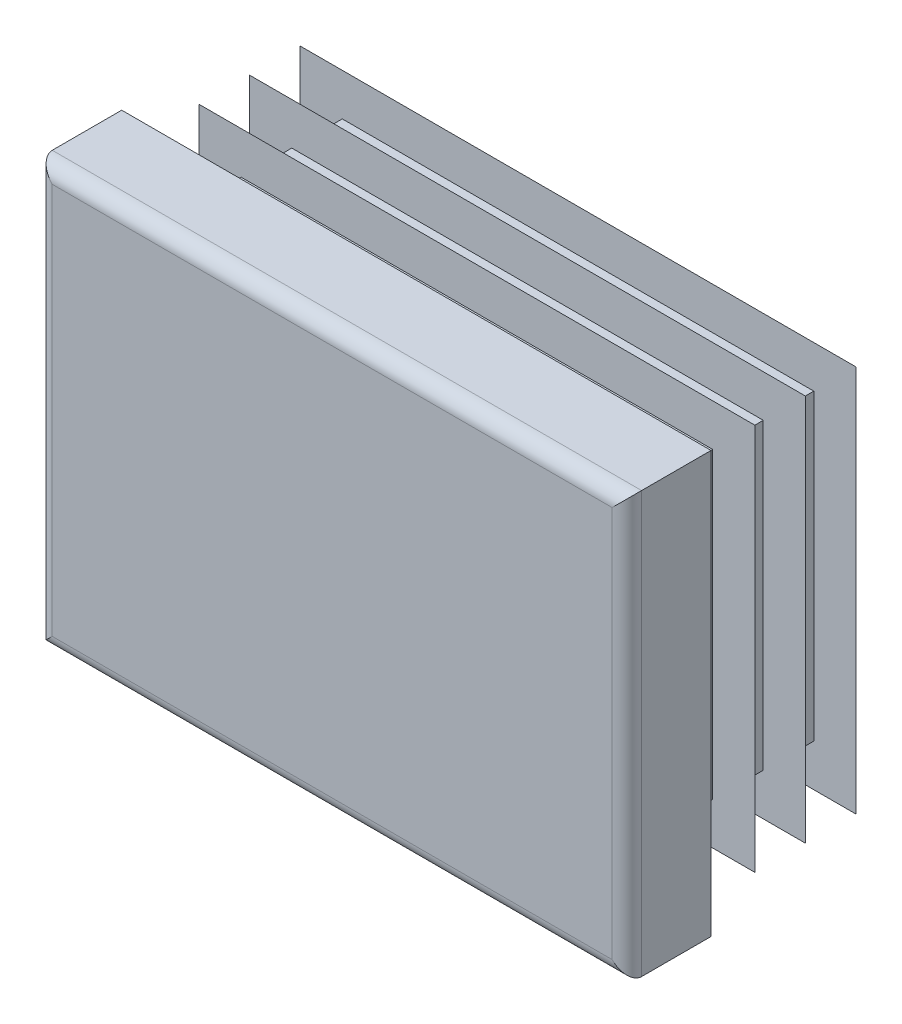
ISO-10303-21;
HEADER;
FILE_DESCRIPTION(('STEP AP214'),'2;1');
FILE_NAME('part.step','',(''),(''),'','','');
FILE_SCHEMA(('AUTOMOTIVE_DESIGN { 1 0 10303 214 1 1 1 1 }'));
ENDSEC;
DATA;
#1=APPLICATION_CONTEXT('core data for automotive mechanical design processes');
#2=APPLICATION_PROTOCOL_DEFINITION('international standard','automotive_design',2000,#1);
#3=PRODUCT_CONTEXT('',#1,'mechanical');
#4=PRODUCT('Part','Part','',(#3));
#5=PRODUCT_RELATED_PRODUCT_CATEGORY('part','',(#4));
#6=PRODUCT_DEFINITION_FORMATION('','',#4);
#7=PRODUCT_DEFINITION_CONTEXT('part definition',#1,'design');
#8=PRODUCT_DEFINITION('design','',#6,#7);
#9=PRODUCT_DEFINITION_SHAPE('','',#8);
#10=(LENGTH_UNIT() NAMED_UNIT(*) SI_UNIT(.MILLI.,.METRE.));
#11=(NAMED_UNIT(*) PLANE_ANGLE_UNIT() SI_UNIT($,.RADIAN.));
#12=(NAMED_UNIT(*) SI_UNIT($,.STERADIAN.) SOLID_ANGLE_UNIT());
#13=UNCERTAINTY_MEASURE_WITH_UNIT(LENGTH_MEASURE(1.E-05),#10,'distance_accuracy_value','');
#14=(GEOMETRIC_REPRESENTATION_CONTEXT(3) GLOBAL_UNCERTAINTY_ASSIGNED_CONTEXT((#13)) GLOBAL_UNIT_ASSIGNED_CONTEXT((#10,
#11,#12)) REPRESENTATION_CONTEXT('',''));
#15=CARTESIAN_POINT('',(0.,0.,0.));
#16=DIRECTION('',(0.,0.,1.));
#17=DIRECTION('',(1.,0.,0.));
#18=AXIS2_PLACEMENT_3D('',#15,#16,#17);
#19=CARTESIAN_POINT('',(16.625,-12.5,5.));
#20=DIRECTION('',(0.,0.,-1.));
#21=DIRECTION('',(0.,1.,0.));
#22=AXIS2_PLACEMENT_3D('',#19,#20,#21);
#23=PLANE('',#22);
#24=DIRECTION('',(0.,1.,0.));
#25=VECTOR('',#24,1.);
#26=CARTESIAN_POINT('',(-16.625,-12.5,5.));
#27=LINE('',#26,#25);
#28=CARTESIAN_POINT('',(-16.625,-11.625,5.));
#29=VERTEX_POINT('',#28);
#30=CARTESIAN_POINT('',(-16.625,11.625,5.));
#31=VERTEX_POINT('',#30);
#32=EDGE_CURVE('E310',#29,#31,#27,.T.);
#33=ORIENTED_EDGE('',*,*,#32,.F.);
#34=DIRECTION('',(-1.,0.,0.));
#35=VECTOR('',#34,1.);
#36=CARTESIAN_POINT('',(17.5,-11.625,5.));
#37=LINE('',#36,#35);
#38=CARTESIAN_POINT('',(16.625,-11.625,5.));
#39=VERTEX_POINT('',#38);
#40=EDGE_CURVE('E482',#39,#29,#37,.T.);
#41=ORIENTED_EDGE('',*,*,#40,.F.);
#42=DIRECTION('',(0.,1.,0.));
#43=VECTOR('',#42,1.);
#44=CARTESIAN_POINT('',(16.625,-12.5,5.));
#45=LINE('',#44,#43);
#46=CARTESIAN_POINT('',(16.625,11.625,5.));
#47=VERTEX_POINT('',#46);
#48=EDGE_CURVE('E305',#39,#47,#45,.T.);
#49=ORIENTED_EDGE('',*,*,#48,.T.);
#50=DIRECTION('',(-1.,0.,0.));
#51=VECTOR('',#50,1.);
#52=CARTESIAN_POINT('',(17.5,11.625,5.));
#53=LINE('',#52,#51);
#54=EDGE_CURVE('E630',#47,#31,#53,.T.);
#55=ORIENTED_EDGE('',*,*,#54,.T.);
#56=EDGE_LOOP('',(#33,#41,#49,#55));
#57=FACE_BOUND('',#56,.T.);
#58=ADVANCED_FACE('F14',(#57),#23,.F.);
#59=CARTESIAN_POINT('',(-16.625,-12.5,4.125));
#60=DIRECTION('',(0.,1.,0.));
#61=DIRECTION('',(-1.,0.,0.));
#62=AXIS2_PLACEMENT_3D('',#59,#60,#61);
#63=CYLINDRICAL_SURFACE('',#62,0.875);
#64=DIRECTION('',(0.,1.,0.));
#65=VECTOR('',#64,1.);
#66=CARTESIAN_POINT('',(-17.5,-12.5,4.125));
#67=LINE('',#66,#65);
#68=CARTESIAN_POINT('',(-17.5,-12.5,4.125));
#69=VERTEX_POINT('',#68);
#70=CARTESIAN_POINT('',(-17.5,12.5,4.125));
#71=VERTEX_POINT('',#70);
#72=EDGE_CURVE('E402',#69,#71,#67,.T.);
#73=ORIENTED_EDGE('',*,*,#72,.F.);
#74=CARTESIAN_POINT('',(-16.625,-11.625,4.125));
#75=DIRECTION('',(-0.707106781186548,0.707106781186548,0.));
#76=DIRECTION('',(0.707106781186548,0.707106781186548,0.));
#77=AXIS2_PLACEMENT_3D('',#74,#75,#76);
#78=ELLIPSE('',#77,1.23743686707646,0.875);
#79=EDGE_CURVE('E59',#69,#29,#78,.T.);
#80=ORIENTED_EDGE('',*,*,#79,.T.);
#81=ORIENTED_EDGE('',*,*,#32,.T.);
#82=CARTESIAN_POINT('',(-16.625,11.625,4.125));
#83=DIRECTION('',(0.707106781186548,0.707106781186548,0.));
#84=DIRECTION('',(-0.707106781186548,0.707106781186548,0.));
#85=AXIS2_PLACEMENT_3D('',#82,#83,#84);
#86=ELLIPSE('',#85,1.23743686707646,0.875);
#87=EDGE_CURVE('E306',#31,#71,#86,.F.);
#88=ORIENTED_EDGE('',*,*,#87,.T.);
#89=EDGE_LOOP('',(#73,#80,#81,#88));
#90=FACE_BOUND('',#89,.T.);
#91=ADVANCED_FACE('F16',(#90),#63,.T.);
#92=CARTESIAN_POINT('',(-17.5,-12.5,4.125));
#93=DIRECTION('',(1.,0.,0.));
#94=DIRECTION('',(0.,1.,0.));
#95=AXIS2_PLACEMENT_3D('',#92,#93,#94);
#96=PLANE('',#95);
#97=DIRECTION('',(0.,0.,-1.));
#98=VECTOR('',#97,1.);
#99=CARTESIAN_POINT('',(-17.5,12.5,4.125));
#100=LINE('',#99,#98);
#101=CARTESIAN_POINT('',(-17.5,12.5,0.));
#102=VERTEX_POINT('',#101);
#103=EDGE_CURVE('E615',#71,#102,#100,.T.);
#104=ORIENTED_EDGE('',*,*,#103,.T.);
#105=DIRECTION('',(0.,1.,0.));
#106=VECTOR('',#105,1.);
#107=CARTESIAN_POINT('',(-17.5,-12.5,0.));
#108=LINE('',#107,#106);
#109=CARTESIAN_POINT('',(-17.5,-12.5,0.));
#110=VERTEX_POINT('',#109);
#111=EDGE_CURVE('E400',#110,#102,#108,.T.);
#112=ORIENTED_EDGE('',*,*,#111,.F.);
#113=DIRECTION('',(0.,0.,-1.));
#114=VECTOR('',#113,1.);
#115=CARTESIAN_POINT('',(-17.5,-12.5,4.125));
#116=LINE('',#115,#114);
#117=EDGE_CURVE('E616',#69,#110,#116,.T.);
#118=ORIENTED_EDGE('',*,*,#117,.F.);
#119=ORIENTED_EDGE('',*,*,#72,.T.);
#120=EDGE_LOOP('',(#104,#112,#118,#119));
#121=FACE_BOUND('',#120,.T.);
#122=ADVANCED_FACE('F697',(#121),#96,.F.);
#123=CARTESIAN_POINT('',(-14.,-12.5,0.));
#124=DIRECTION('',(1.,0.,0.));
#125=DIRECTION('',(0.,1.,0.));
#126=AXIS2_PLACEMENT_3D('',#123,#124,#125);
#127=PLANE('',#126);
#128=DIRECTION('',(0.,1.,0.));
#129=VECTOR('',#128,1.);
#130=CARTESIAN_POINT('',(-14.,-12.5,0.));
#131=LINE('',#130,#129);
#132=CARTESIAN_POINT('',(-14.,-9.,0.));
#133=VERTEX_POINT('',#132);
#134=CARTESIAN_POINT('',(-14.,9.,0.));
#135=VERTEX_POINT('',#134);
#136=EDGE_CURVE('E397',#133,#135,#131,.T.);
#137=ORIENTED_EDGE('',*,*,#136,.T.);
#138=DIRECTION('',(0.,0.,-1.));
#139=VECTOR('',#138,1.);
#140=CARTESIAN_POINT('',(-14.,9.,0.));
#141=LINE('',#140,#139);
#142=CARTESIAN_POINT('',(-14.,9.,-0.6));
#143=VERTEX_POINT('',#142);
#144=EDGE_CURVE('E495',#135,#143,#141,.T.);
#145=ORIENTED_EDGE('',*,*,#144,.T.);
#146=DIRECTION('',(0.,1.,0.));
#147=VECTOR('',#146,1.);
#148=CARTESIAN_POINT('',(-14.,-12.5,-0.6));
#149=LINE('',#148,#147);
#150=CARTESIAN_POINT('',(-14.,-9.,-0.6));
#151=VERTEX_POINT('',#150);
#152=EDGE_CURVE('E394',#151,#143,#149,.T.);
#153=ORIENTED_EDGE('',*,*,#152,.F.);
#154=DIRECTION('',(0.,0.,1.));
#155=VECTOR('',#154,1.);
#156=CARTESIAN_POINT('',(-14.,-9.,0.));
#157=LINE('',#156,#155);
#158=EDGE_CURVE('E489',#151,#133,#157,.T.);
#159=ORIENTED_EDGE('',*,*,#158,.T.);
#160=EDGE_LOOP('',(#137,#145,#153,#159));
#161=FACE_BOUND('',#160,.T.);
#162=ADVANCED_FACE('F787',(#161),#127,.F.);
#163=CARTESIAN_POINT('',(-16.5,-12.5,-0.6));
#164=DIRECTION('',(0.342020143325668,0.,0.939692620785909));
#165=DIRECTION('',(-0.939692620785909,0.,0.342020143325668));
#166=AXIS2_PLACEMENT_3D('',#163,#164,#165);
#167=PLANE('',#166);
#168=DIRECTION('',(0.,1.,0.));
#169=VECTOR('',#168,1.);
#170=CARTESIAN_POINT('',(-16.5,-12.5,-0.6));
#171=LINE('',#170,#169);
#172=CARTESIAN_POINT('',(-16.5,-11.5,-0.6));
#173=VERTEX_POINT('',#172);
#174=CARTESIAN_POINT('',(-16.5,11.5,-0.6));
#175=VERTEX_POINT('',#174);
#176=EDGE_CURVE('E392',#173,#175,#171,.T.);
#177=ORIENTED_EDGE('',*,*,#176,.T.);
#178=DIRECTION('',(0.844349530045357,-0.43889572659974,-0.307318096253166));
#179=VECTOR('',#178,1.);
#180=CARTESIAN_POINT('',(-7.60604638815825,6.87689298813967,-3.83713437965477));
#181=LINE('',#180,#179);
#182=CARTESIAN_POINT('',(-14.,10.2004915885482,-1.5099255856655));
#183=VERTEX_POINT('',#182);
#184=EDGE_CURVE('E519',#175,#183,#181,.T.);
#185=ORIENTED_EDGE('',*,*,#184,.T.);
#186=DIRECTION('',(0.,1.,0.));
#187=VECTOR('',#186,1.);
#188=CARTESIAN_POINT('',(-14.,-12.5,-1.5099255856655));
#189=LINE('',#188,#187);
#190=CARTESIAN_POINT('',(-14.,-10.2004915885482,-1.5099255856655));
#191=VERTEX_POINT('',#190);
#192=EDGE_CURVE('E389',#191,#183,#189,.T.);
#193=ORIENTED_EDGE('',*,*,#192,.F.);
#194=DIRECTION('',(-0.844349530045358,-0.438895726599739,0.307318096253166));
#195=VECTOR('',#194,1.);
#196=CARTESIAN_POINT('',(-16.8705814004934,-11.6926294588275,-0.465119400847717));
#197=LINE('',#196,#195);
#198=EDGE_CURVE('E507',#191,#173,#197,.T.);
#199=ORIENTED_EDGE('',*,*,#198,.T.);
#200=EDGE_LOOP('',(#177,#185,#193,#199));
#201=FACE_BOUND('',#200,.T.);
#202=ADVANCED_FACE('F783',(#201),#167,.F.);
#203=CARTESIAN_POINT('',(-14.,-12.5,-1.5099255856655));
#204=DIRECTION('',(1.,0.,0.));
#205=DIRECTION('',(0.,1.,0.));
#206=AXIS2_PLACEMENT_3D('',#203,#204,#205);
#207=PLANE('',#206);
#208=ORIENTED_EDGE('',*,*,#192,.T.);
#209=DIRECTION('',(0.,-0.819152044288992,-0.573576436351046));
#210=VECTOR('',#209,1.);
#211=CARTESIAN_POINT('',(-14.,-5.0317668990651,-12.1756678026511));
#212=LINE('',#211,#210);
#213=CARTESIAN_POINT('',(-14.,9.,-2.35051884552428));
#214=VERTEX_POINT('',#213);
#215=EDGE_CURVE('E516',#183,#214,#212,.T.);
#216=ORIENTED_EDGE('',*,*,#215,.T.);
#217=DIRECTION('',(0.,0.,-1.));
#218=VECTOR('',#217,1.);
#219=CARTESIAN_POINT('',(-14.,9.,-1.5099255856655));
#220=LINE('',#219,#218);
#221=CARTESIAN_POINT('',(-14.,9.,-3.6));
#222=VERTEX_POINT('',#221);
#223=EDGE_CURVE('E525',#214,#222,#220,.T.);
#224=ORIENTED_EDGE('',*,*,#223,.T.);
#225=DIRECTION('',(0.,1.,0.));
#226=VECTOR('',#225,1.);
#227=CARTESIAN_POINT('',(-14.,-12.5,-3.6));
#228=LINE('',#227,#226);
#229=CARTESIAN_POINT('',(-14.,-9.,-3.6));
#230=VERTEX_POINT('',#229);
#231=EDGE_CURVE('E386',#230,#222,#228,.T.);
#232=ORIENTED_EDGE('',*,*,#231,.F.);
#233=DIRECTION('',(0.,0.,1.));
#234=VECTOR('',#233,1.);
#235=CARTESIAN_POINT('',(-14.,-9.,-1.5099255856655));
#236=LINE('',#235,#234);
#237=CARTESIAN_POINT('',(-14.,-9.,-2.35051884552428));
#238=VERTEX_POINT('',#237);
#239=EDGE_CURVE('E522',#230,#238,#236,.T.);
#240=ORIENTED_EDGE('',*,*,#239,.T.);
#241=DIRECTION('',(0.,-0.819152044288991,0.573576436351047));
#242=VECTOR('',#241,1.);
#243=CARTESIAN_POINT('',(-14.,-11.7434848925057,-0.429510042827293));
#244=LINE('',#243,#242);
#245=EDGE_CURVE('E504',#238,#191,#244,.T.);
#246=ORIENTED_EDGE('',*,*,#245,.T.);
#247=EDGE_LOOP('',(#208,#216,#224,#232,#240,#246));
#248=FACE_BOUND('',#247,.T.);
#249=ADVANCED_FACE('F779',(#248),#207,.F.);
#250=CARTESIAN_POINT('',(-16.5,-12.5,-3.6));
#251=DIRECTION('',(0.34202014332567,0.,0.939692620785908));
#252=DIRECTION('',(-0.939692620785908,0.,0.34202014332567));
#253=AXIS2_PLACEMENT_3D('',#250,#251,#252);
#254=PLANE('',#253);
#255=DIRECTION('',(0.,1.,0.));
#256=VECTOR('',#255,1.);
#257=CARTESIAN_POINT('',(-16.5,-12.5,-3.6));
#258=LINE('',#257,#256);
#259=CARTESIAN_POINT('',(-16.5,-11.5,-3.6));
#260=VERTEX_POINT('',#259);
#261=CARTESIAN_POINT('',(-16.5,11.5,-3.6));
#262=VERTEX_POINT('',#261);
#263=EDGE_CURVE('E384',#260,#262,#258,.T.);
#264=ORIENTED_EDGE('',*,*,#263,.T.);
#265=DIRECTION('',(0.844349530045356,-0.438895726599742,-0.307318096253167));
#266=VECTOR('',#265,1.);
#267=CARTESIAN_POINT('',(-7.60604638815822,6.87689298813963,-6.8371343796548));
#268=LINE('',#267,#266);
#269=CARTESIAN_POINT('',(-14.,10.2004915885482,-4.50992558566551));
#270=VERTEX_POINT('',#269);
#271=EDGE_CURVE('E549',#262,#270,#268,.T.);
#272=ORIENTED_EDGE('',*,*,#271,.T.);
#273=DIRECTION('',(0.,1.,0.));
#274=VECTOR('',#273,1.);
#275=CARTESIAN_POINT('',(-14.,-12.5,-4.50992558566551));
#276=LINE('',#275,#274);
#277=CARTESIAN_POINT('',(-14.,-10.2004915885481,-4.50992558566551));
#278=VERTEX_POINT('',#277);
#279=EDGE_CURVE('E381',#278,#270,#276,.T.);
#280=ORIENTED_EDGE('',*,*,#279,.F.);
#281=DIRECTION('',(-0.844349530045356,-0.438895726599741,0.307318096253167));
#282=VECTOR('',#281,1.);
#283=CARTESIAN_POINT('',(-16.8705814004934,-11.6926294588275,-3.46511940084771));
#284=LINE('',#283,#282);
#285=EDGE_CURVE('E537',#278,#260,#284,.T.);
#286=ORIENTED_EDGE('',*,*,#285,.T.);
#287=EDGE_LOOP('',(#264,#272,#280,#286));
#288=FACE_BOUND('',#287,.T.);
#289=ADVANCED_FACE('F775',(#288),#254,.F.);
#290=CARTESIAN_POINT('',(-14.,-12.5,-4.50992558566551));
#291=DIRECTION('',(1.,0.,0.));
#292=DIRECTION('',(0.,1.,0.));
#293=AXIS2_PLACEMENT_3D('',#290,#291,#292);
#294=PLANE('',#293);
#295=ORIENTED_EDGE('',*,*,#279,.T.);
#296=DIRECTION('',(0.,-0.819152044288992,-0.573576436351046));
#297=VECTOR('',#296,1.);
#298=CARTESIAN_POINT('',(-14.,-5.03176689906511,-15.1756678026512));
#299=LINE('',#298,#297);
#300=CARTESIAN_POINT('',(-14.,9.,-5.35051884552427));
#301=VERTEX_POINT('',#300);
#302=EDGE_CURVE('E546',#270,#301,#299,.T.);
#303=ORIENTED_EDGE('',*,*,#302,.T.);
#304=DIRECTION('',(0.,0.,-1.));
#305=VECTOR('',#304,1.);
#306=CARTESIAN_POINT('',(-14.,9.,-4.50992558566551));
#307=LINE('',#306,#305);
#308=CARTESIAN_POINT('',(-14.,9.,-6.6));
#309=VERTEX_POINT('',#308);
#310=EDGE_CURVE('E555',#301,#309,#307,.T.);
#311=ORIENTED_EDGE('',*,*,#310,.T.);
#312=DIRECTION('',(0.,1.,0.));
#313=VECTOR('',#312,1.);
#314=CARTESIAN_POINT('',(-14.,-12.5,-6.6));
#315=LINE('',#314,#313);
#316=CARTESIAN_POINT('',(-14.,-9.,-6.6));
#317=VERTEX_POINT('',#316);
#318=EDGE_CURVE('E378',#317,#309,#315,.T.);
#319=ORIENTED_EDGE('',*,*,#318,.F.);
#320=DIRECTION('',(0.,0.,1.));
#321=VECTOR('',#320,1.);
#322=CARTESIAN_POINT('',(-14.,-9.,-4.50992558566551));
#323=LINE('',#322,#321);
#324=CARTESIAN_POINT('',(-14.,-9.,-5.35051884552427));
#325=VERTEX_POINT('',#324);
#326=EDGE_CURVE('E552',#317,#325,#323,.T.);
#327=ORIENTED_EDGE('',*,*,#326,.T.);
#328=DIRECTION('',(0.,-0.819152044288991,0.573576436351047));
#329=VECTOR('',#328,1.);
#330=CARTESIAN_POINT('',(-14.,-11.7434848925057,-3.42951004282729));
#331=LINE('',#330,#329);
#332=EDGE_CURVE('E534',#325,#278,#331,.T.);
#333=ORIENTED_EDGE('',*,*,#332,.T.);
#334=EDGE_LOOP('',(#295,#303,#311,#319,#327,#333));
#335=FACE_BOUND('',#334,.T.);
#336=ADVANCED_FACE('F771',(#335),#294,.F.);
#337=CARTESIAN_POINT('',(-16.5,-12.5,-6.6));
#338=DIRECTION('',(0.34202014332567,0.,0.939692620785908));
#339=DIRECTION('',(-0.939692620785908,0.,0.34202014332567));
#340=AXIS2_PLACEMENT_3D('',#337,#338,#339);
#341=PLANE('',#340);
#342=DIRECTION('',(0.,1.,0.));
#343=VECTOR('',#342,1.);
#344=CARTESIAN_POINT('',(-16.5,-12.5,-6.6));
#345=LINE('',#344,#343);
#346=CARTESIAN_POINT('',(-16.5,-11.5,-6.6));
#347=VERTEX_POINT('',#346);
#348=CARTESIAN_POINT('',(-16.5,11.5,-6.6));
#349=VERTEX_POINT('',#348);
#350=EDGE_CURVE('E376',#347,#349,#345,.T.);
#351=ORIENTED_EDGE('',*,*,#350,.T.);
#352=DIRECTION('',(0.844349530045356,-0.438895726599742,-0.307318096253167));
#353=VECTOR('',#352,1.);
#354=CARTESIAN_POINT('',(-7.60604638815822,6.87689298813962,-9.8371343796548));
#355=LINE('',#354,#353);
#356=CARTESIAN_POINT('',(-14.,10.2004915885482,-7.50992558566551));
#357=VERTEX_POINT('',#356);
#358=EDGE_CURVE('E579',#349,#357,#355,.T.);
#359=ORIENTED_EDGE('',*,*,#358,.T.);
#360=DIRECTION('',(0.,1.,0.));
#361=VECTOR('',#360,1.);
#362=CARTESIAN_POINT('',(-14.,-12.5,-7.50992558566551));
#363=LINE('',#362,#361);
#364=CARTESIAN_POINT('',(-14.,-10.2004915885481,-7.50992558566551));
#365=VERTEX_POINT('',#364);
#366=EDGE_CURVE('E373',#365,#357,#363,.T.);
#367=ORIENTED_EDGE('',*,*,#366,.F.);
#368=DIRECTION('',(-0.844349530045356,-0.438895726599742,0.307318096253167));
#369=VECTOR('',#368,1.);
#370=CARTESIAN_POINT('',(-16.8705814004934,-11.6926294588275,-6.46511940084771));
#371=LINE('',#370,#369);
#372=EDGE_CURVE('E567',#365,#347,#371,.T.);
#373=ORIENTED_EDGE('',*,*,#372,.T.);
#374=EDGE_LOOP('',(#351,#359,#367,#373));
#375=FACE_BOUND('',#374,.T.);
#376=ADVANCED_FACE('F767',(#375),#341,.F.);
#377=CARTESIAN_POINT('',(-14.,-12.5,-7.50992558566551));
#378=DIRECTION('',(1.,0.,0.));
#379=DIRECTION('',(0.,1.,0.));
#380=AXIS2_PLACEMENT_3D('',#377,#378,#379);
#381=PLANE('',#380);
#382=ORIENTED_EDGE('',*,*,#366,.T.);
#383=DIRECTION('',(0.,-0.819152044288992,-0.573576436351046));
#384=VECTOR('',#383,1.);
#385=CARTESIAN_POINT('',(-14.,-5.03176689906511,-18.1756678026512));
#386=LINE('',#385,#384);
#387=CARTESIAN_POINT('',(-14.,9.,-8.35051884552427));
#388=VERTEX_POINT('',#387);
#389=EDGE_CURVE('E576',#357,#388,#386,.T.);
#390=ORIENTED_EDGE('',*,*,#389,.T.);
#391=DIRECTION('',(0.,0.,-1.));
#392=VECTOR('',#391,1.);
#393=CARTESIAN_POINT('',(-14.,9.,-7.50992558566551));
#394=LINE('',#393,#392);
#395=CARTESIAN_POINT('',(-14.,9.,-9.6));
#396=VERTEX_POINT('',#395);
#397=EDGE_CURVE('E585',#388,#396,#394,.T.);
#398=ORIENTED_EDGE('',*,*,#397,.T.);
#399=DIRECTION('',(0.,1.,0.));
#400=VECTOR('',#399,1.);
#401=CARTESIAN_POINT('',(-14.,-12.5,-9.6));
#402=LINE('',#401,#400);
#403=CARTESIAN_POINT('',(-14.,-9.,-9.6));
#404=VERTEX_POINT('',#403);
#405=EDGE_CURVE('E370',#404,#396,#402,.T.);
#406=ORIENTED_EDGE('',*,*,#405,.F.);
#407=DIRECTION('',(0.,0.,1.));
#408=VECTOR('',#407,1.);
#409=CARTESIAN_POINT('',(-14.,-9.,-7.50992558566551));
#410=LINE('',#409,#408);
#411=CARTESIAN_POINT('',(-14.,-9.,-8.35051884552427));
#412=VERTEX_POINT('',#411);
#413=EDGE_CURVE('E582',#404,#412,#410,.T.);
#414=ORIENTED_EDGE('',*,*,#413,.T.);
#415=DIRECTION('',(0.,-0.819152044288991,0.573576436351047));
#416=VECTOR('',#415,1.);
#417=CARTESIAN_POINT('',(-14.,-11.7434848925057,-6.42951004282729));
#418=LINE('',#417,#416);
#419=EDGE_CURVE('E564',#412,#365,#418,.T.);
#420=ORIENTED_EDGE('',*,*,#419,.T.);
#421=EDGE_LOOP('',(#382,#390,#398,#406,#414,#420));
#422=FACE_BOUND('',#421,.T.);
#423=ADVANCED_FACE('F764',(#422),#381,.F.);
#424=CARTESIAN_POINT('',(-16.5,-12.5,-9.6));
#425=DIRECTION('',(0.342020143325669,0.,0.939692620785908));
#426=DIRECTION('',(-0.939692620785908,0.,0.342020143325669));
#427=AXIS2_PLACEMENT_3D('',#424,#425,#426);
#428=PLANE('',#427);
#429=DIRECTION('',(0.,1.,0.));
#430=VECTOR('',#429,1.);
#431=CARTESIAN_POINT('',(-16.5,-12.5,-9.6));
#432=LINE('',#431,#430);
#433=CARTESIAN_POINT('',(-16.5,-11.5,-9.6));
#434=VERTEX_POINT('',#433);
#435=CARTESIAN_POINT('',(-16.5,11.5,-9.6));
#436=VERTEX_POINT('',#435);
#437=EDGE_CURVE('E368',#434,#436,#432,.T.);
#438=ORIENTED_EDGE('',*,*,#437,.T.);
#439=DIRECTION('',(0.844349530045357,-0.438895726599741,-0.307318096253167));
#440=VECTOR('',#439,1.);
#441=CARTESIAN_POINT('',(-7.60604638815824,6.87689298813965,-12.8371343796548));
#442=LINE('',#441,#440);
#443=CARTESIAN_POINT('',(-14.,10.2004915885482,-10.5099255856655));
#444=VERTEX_POINT('',#443);
#445=EDGE_CURVE('E607',#436,#444,#442,.T.);
#446=ORIENTED_EDGE('',*,*,#445,.T.);
#447=DIRECTION('',(0.,1.,0.));
#448=VECTOR('',#447,1.);
#449=CARTESIAN_POINT('',(-14.,-12.5,-10.5099255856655));
#450=LINE('',#449,#448);
#451=CARTESIAN_POINT('',(-14.,-10.2004915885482,-10.5099255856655));
#452=VERTEX_POINT('',#451);
#453=EDGE_CURVE('E365',#452,#444,#450,.T.);
#454=ORIENTED_EDGE('',*,*,#453,.F.);
#455=DIRECTION('',(-0.844349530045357,-0.438895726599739,0.307318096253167));
#456=VECTOR('',#455,1.);
#457=CARTESIAN_POINT('',(-16.8705814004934,-11.6926294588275,-9.46511940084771));
#458=LINE('',#457,#456);
#459=EDGE_CURVE('E595',#452,#434,#458,.T.);
#460=ORIENTED_EDGE('',*,*,#459,.T.);
#461=EDGE_LOOP('',(#438,#446,#454,#460));
#462=FACE_BOUND('',#461,.T.);
#463=ADVANCED_FACE('F675',(#462),#428,.F.);
#464=CARTESIAN_POINT('',(-14.,-12.5,-10.5099255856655));
#465=DIRECTION('',(1.,0.,0.));
#466=DIRECTION('',(0.,1.,0.));
#467=AXIS2_PLACEMENT_3D('',#464,#465,#466);
#468=PLANE('',#467);
#469=ORIENTED_EDGE('',*,*,#453,.T.);
#470=DIRECTION('',(0.,-0.819152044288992,-0.573576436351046));
#471=VECTOR('',#470,1.);
#472=CARTESIAN_POINT('',(-14.,-5.0317668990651,-21.1756678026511));
#473=LINE('',#472,#471);
#474=CARTESIAN_POINT('',(-14.,9.,-11.3505188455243));
#475=VERTEX_POINT('',#474);
#476=EDGE_CURVE('E604',#444,#475,#473,.T.);
#477=ORIENTED_EDGE('',*,*,#476,.T.);
#478=DIRECTION('',(0.,0.,-1.));
#479=VECTOR('',#478,1.);
#480=CARTESIAN_POINT('',(-14.,9.,-10.5099255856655));
#481=LINE('',#480,#479);
#482=CARTESIAN_POINT('',(-14.,9.,-12.));
#483=VERTEX_POINT('',#482);
#484=EDGE_CURVE('E613',#475,#483,#481,.T.);
#485=ORIENTED_EDGE('',*,*,#484,.T.);
#486=DIRECTION('',(0.,1.,0.));
#487=VECTOR('',#486,1.);
#488=CARTESIAN_POINT('',(-14.,-12.5,-12.));
#489=LINE('',#488,#487);
#490=CARTESIAN_POINT('',(-14.,-9.,-12.));
#491=VERTEX_POINT('',#490);
#492=EDGE_CURVE('E362',#491,#483,#489,.T.);
#493=ORIENTED_EDGE('',*,*,#492,.F.);
#494=DIRECTION('',(0.,0.,1.));
#495=VECTOR('',#494,1.);
#496=CARTESIAN_POINT('',(-14.,-9.,-10.5099255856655));
#497=LINE('',#496,#495);
#498=CARTESIAN_POINT('',(-14.,-9.,-11.3505188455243));
#499=VERTEX_POINT('',#498);
#500=EDGE_CURVE('E610',#491,#499,#497,.T.);
#501=ORIENTED_EDGE('',*,*,#500,.T.);
#502=DIRECTION('',(0.,-0.81915204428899,0.573576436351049));
#503=VECTOR('',#502,1.);
#504=CARTESIAN_POINT('',(-14.,-11.7434848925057,-9.42951004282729));
#505=LINE('',#504,#503);
#506=EDGE_CURVE('E592',#499,#452,#505,.T.);
#507=ORIENTED_EDGE('',*,*,#506,.T.);
#508=EDGE_LOOP('',(#469,#477,#485,#493,#501,#507));
#509=FACE_BOUND('',#508,.T.);
#510=ADVANCED_FACE('F677',(#509),#468,.F.);
#511=CARTESIAN_POINT('',(-14.,-12.5,-12.));
#512=DIRECTION('',(0.,0.,1.));
#513=DIRECTION('',(0.,-1.,0.));
#514=AXIS2_PLACEMENT_3D('',#511,#512,#513);
#515=PLANE('',#514);
#516=ORIENTED_EDGE('',*,*,#492,.T.);
#517=DIRECTION('',(-1.,0.,0.));
#518=VECTOR('',#517,1.);
#519=CARTESIAN_POINT('',(17.5,9.,-12.));
#520=LINE('',#519,#518);
#521=CARTESIAN_POINT('',(14.,9.,-12.));
#522=VERTEX_POINT('',#521);
#523=EDGE_CURVE('E438',#522,#483,#520,.T.);
#524=ORIENTED_EDGE('',*,*,#523,.F.);
#525=DIRECTION('',(0.,1.,0.));
#526=VECTOR('',#525,1.);
#527=CARTESIAN_POINT('',(14.,-12.5,-12.));
#528=LINE('',#527,#526);
#529=CARTESIAN_POINT('',(14.,-9.,-12.));
#530=VERTEX_POINT('',#529);
#531=EDGE_CURVE('E359',#530,#522,#528,.T.);
#532=ORIENTED_EDGE('',*,*,#531,.F.);
#533=DIRECTION('',(-1.,0.,0.));
#534=VECTOR('',#533,1.);
#535=CARTESIAN_POINT('',(17.5,-9.,-12.));
#536=LINE('',#535,#534);
#537=EDGE_CURVE('E436',#530,#491,#536,.T.);
#538=ORIENTED_EDGE('',*,*,#537,.T.);
#539=EDGE_LOOP('',(#516,#524,#532,#538));
#540=FACE_BOUND('',#539,.T.);
#541=ADVANCED_FACE('F435',(#540),#515,.F.);
#542=CARTESIAN_POINT('',(14.,-12.5,-12.));
#543=DIRECTION('',(-1.,0.,0.));
#544=DIRECTION('',(0.,-1.,0.));
#545=AXIS2_PLACEMENT_3D('',#542,#543,#544);
#546=PLANE('',#545);
#547=DIRECTION('',(0.,0.,1.));
#548=VECTOR('',#547,1.);
#549=CARTESIAN_POINT('',(14.,9.,-12.));
#550=LINE('',#549,#548);
#551=CARTESIAN_POINT('',(14.,9.,-11.3505188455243));
#552=VERTEX_POINT('',#551);
#553=EDGE_CURVE('E9',#522,#552,#550,.T.);
#554=ORIENTED_EDGE('',*,*,#553,.T.);
#555=DIRECTION('',(0.,0.819152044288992,0.573576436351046));
#556=VECTOR('',#555,1.);
#557=CARTESIAN_POINT('',(14.,-5.73187286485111,-21.6658872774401));
#558=LINE('',#557,#556);
#559=CARTESIAN_POINT('',(14.,10.2004915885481,-10.5099255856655));
#560=VERTEX_POINT('',#559);
#561=EDGE_CURVE('E601',#552,#560,#558,.T.);
#562=ORIENTED_EDGE('',*,*,#561,.T.);
#563=DIRECTION('',(0.,1.,0.));
#564=VECTOR('',#563,1.);
#565=CARTESIAN_POINT('',(14.,-12.5,-10.5099255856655));
#566=LINE('',#565,#564);
#567=CARTESIAN_POINT('',(14.,-10.2004915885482,-10.5099255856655));
#568=VERTEX_POINT('',#567);
#569=EDGE_CURVE('E356',#568,#560,#566,.T.);
#570=ORIENTED_EDGE('',*,*,#569,.F.);
#571=DIRECTION('',(0.,0.81915204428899,-0.573576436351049));
#572=VECTOR('',#571,1.);
#573=CARTESIAN_POINT('',(14.,-11.0433789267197,-9.91972951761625));
#574=LINE('',#573,#572);
#575=CARTESIAN_POINT('',(14.,-9.,-11.3505188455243));
#576=VERTEX_POINT('',#575);
#577=EDGE_CURVE('E428',#568,#576,#574,.T.);
#578=ORIENTED_EDGE('',*,*,#577,.T.);
#579=DIRECTION('',(0.,0.,-1.));
#580=VECTOR('',#579,1.);
#581=CARTESIAN_POINT('',(14.,-9.,-12.));
#582=LINE('',#581,#580);
#583=EDGE_CURVE('E23',#576,#530,#582,.T.);
#584=ORIENTED_EDGE('',*,*,#583,.T.);
#585=ORIENTED_EDGE('',*,*,#531,.T.);
#586=EDGE_LOOP('',(#554,#562,#570,#578,#584,#585));
#587=FACE_BOUND('',#586,.T.);
#588=ADVANCED_FACE('F426',(#587),#546,.F.);
#589=CARTESIAN_POINT('',(14.,-12.5,-10.5099255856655));
#590=DIRECTION('',(-0.342020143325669,0.,0.939692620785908));
#591=DIRECTION('',(-0.939692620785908,0.,-0.342020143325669));
#592=AXIS2_PLACEMENT_3D('',#589,#590,#591);
#593=PLANE('',#592);
#594=ORIENTED_EDGE('',*,*,#569,.T.);
#595=DIRECTION('',(0.844349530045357,0.438895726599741,0.307318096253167));
#596=VECTOR('',#595,1.);
#597=CARTESIAN_POINT('',(5.58762003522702,5.82770817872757,-13.5717814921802));
#598=LINE('',#597,#596);
#599=CARTESIAN_POINT('',(16.5,11.5,-9.6));
#600=VERTEX_POINT('',#599);
#601=EDGE_CURVE('E598',#560,#600,#598,.T.);
#602=ORIENTED_EDGE('',*,*,#601,.T.);
#603=DIRECTION('',(0.,1.,0.));
#604=VECTOR('',#603,1.);
#605=CARTESIAN_POINT('',(16.5,-12.5,-9.6));
#606=LINE('',#605,#604);
#607=CARTESIAN_POINT('',(16.5,-11.5,-9.6));
#608=VERTEX_POINT('',#607);
#609=EDGE_CURVE('E353',#608,#600,#606,.T.);
#610=ORIENTED_EDGE('',*,*,#609,.F.);
#611=DIRECTION('',(-0.844349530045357,0.438895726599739,-0.307318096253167));
#612=VECTOR('',#611,1.);
#613=CARTESIAN_POINT('',(14.8521550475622,-10.6434446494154,-10.1997665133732));
#614=LINE('',#613,#612);
#615=EDGE_CURVE('E588',#608,#568,#614,.T.);
#616=ORIENTED_EDGE('',*,*,#615,.T.);
#617=EDGE_LOOP('',(#594,#602,#610,#616));
#618=FACE_BOUND('',#617,.T.);
#619=ADVANCED_FACE('F752',(#618),#593,.F.);
#620=CARTESIAN_POINT('',(16.5,-12.5,-9.6));
#621=DIRECTION('',(0.,0.,-1.));
#622=DIRECTION('',(0.,1.,0.));
#623=AXIS2_PLACEMENT_3D('',#620,#621,#622);
#624=PLANE('',#623);
#625=ORIENTED_EDGE('',*,*,#609,.T.);
#626=DIRECTION('',(-1.,0.,0.));
#627=VECTOR('',#626,1.);
#628=CARTESIAN_POINT('',(17.5,11.5,-9.6));
#629=LINE('',#628,#627);
#630=EDGE_CURVE('E444',#600,#436,#629,.T.);
#631=ORIENTED_EDGE('',*,*,#630,.T.);
#632=ORIENTED_EDGE('',*,*,#437,.F.);
#633=DIRECTION('',(-1.,0.,0.));
#634=VECTOR('',#633,1.);
#635=CARTESIAN_POINT('',(17.5,-11.5,-9.6));
#636=LINE('',#635,#634);
#637=EDGE_CURVE('E451',#608,#434,#636,.T.);
#638=ORIENTED_EDGE('',*,*,#637,.F.);
#639=EDGE_LOOP('',(#625,#631,#632,#638));
#640=FACE_BOUND('',#639,.T.);
#641=ORIENTED_EDGE('',*,*,#405,.T.);
#642=DIRECTION('',(-1.,0.,0.));
#643=VECTOR('',#642,1.);
#644=CARTESIAN_POINT('',(17.5,9.,-9.6));
#645=LINE('',#644,#643);
#646=CARTESIAN_POINT('',(14.,9.,-9.6));
#647=VERTEX_POINT('',#646);
#648=EDGE_CURVE('E663',#647,#396,#645,.T.);
#649=ORIENTED_EDGE('',*,*,#648,.F.);
#650=DIRECTION('',(0.,1.,0.));
#651=VECTOR('',#650,1.);
#652=CARTESIAN_POINT('',(14.,-12.5,-9.6));
#653=LINE('',#652,#651);
#654=CARTESIAN_POINT('',(14.,-9.,-9.6));
#655=VERTEX_POINT('',#654);
#656=EDGE_CURVE('E350',#655,#647,#653,.T.);
#657=ORIENTED_EDGE('',*,*,#656,.F.);
#658=DIRECTION('',(-1.,0.,0.));
#659=VECTOR('',#658,1.);
#660=CARTESIAN_POINT('',(17.5,-9.,-9.6));
#661=LINE('',#660,#659);
#662=EDGE_CURVE('E453',#655,#404,#661,.T.);
#663=ORIENTED_EDGE('',*,*,#662,.T.);
#664=EDGE_LOOP('',(#641,#649,#657,#663));
#665=FACE_BOUND('',#664,.T.);
#666=ADVANCED_FACE('F667',(#640,#665),#624,.F.);
#667=CARTESIAN_POINT('',(14.,-12.5,-9.6));
#668=DIRECTION('',(-1.,0.,0.));
#669=DIRECTION('',(0.,-1.,0.));
#670=AXIS2_PLACEMENT_3D('',#667,#668,#669);
#671=PLANE('',#670);
#672=DIRECTION('',(0.,0.,1.));
#673=VECTOR('',#672,1.);
#674=CARTESIAN_POINT('',(14.,9.,-9.6));
#675=LINE('',#674,#673);
#676=CARTESIAN_POINT('',(14.,9.,-8.35051884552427));
#677=VERTEX_POINT('',#676);
#678=EDGE_CURVE('E420',#647,#677,#675,.T.);
#679=ORIENTED_EDGE('',*,*,#678,.T.);
#680=DIRECTION('',(0.,0.819152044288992,0.573576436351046));
#681=VECTOR('',#680,1.);
#682=CARTESIAN_POINT('',(14.,-6.01378065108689,-18.8632812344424));
#683=LINE('',#682,#681);
#684=CARTESIAN_POINT('',(14.,10.2004915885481,-7.50992558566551));
#685=VERTEX_POINT('',#684);
#686=EDGE_CURVE('E573',#677,#685,#683,.T.);
#687=ORIENTED_EDGE('',*,*,#686,.T.);
#688=DIRECTION('',(0.,1.,0.));
#689=VECTOR('',#688,1.);
#690=CARTESIAN_POINT('',(14.,-12.5,-7.50992558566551));
#691=LINE('',#690,#689);
#692=CARTESIAN_POINT('',(14.,-10.2004915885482,-7.50992558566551));
#693=VERTEX_POINT('',#692);
#694=EDGE_CURVE('E347',#693,#685,#691,.T.);
#695=ORIENTED_EDGE('',*,*,#694,.F.);
#696=DIRECTION('',(0.,0.819152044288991,-0.573576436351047));
#697=VECTOR('',#696,1.);
#698=CARTESIAN_POINT('',(14.,-10.761471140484,-7.11712347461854));
#699=LINE('',#698,#697);
#700=CARTESIAN_POINT('',(14.,-9.,-8.35051884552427));
#701=VERTEX_POINT('',#700);
#702=EDGE_CURVE('E561',#693,#701,#699,.T.);
#703=ORIENTED_EDGE('',*,*,#702,.T.);
#704=DIRECTION('',(0.,0.,-1.));
#705=VECTOR('',#704,1.);
#706=CARTESIAN_POINT('',(14.,-9.,-9.6));
#707=LINE('',#706,#705);
#708=EDGE_CURVE('E417',#701,#655,#707,.T.);
#709=ORIENTED_EDGE('',*,*,#708,.T.);
#710=ORIENTED_EDGE('',*,*,#656,.T.);
#711=EDGE_LOOP('',(#679,#687,#695,#703,#709,#710));
#712=FACE_BOUND('',#711,.T.);
#713=ADVANCED_FACE('F745',(#712),#671,.F.);
#714=CARTESIAN_POINT('',(14.,-12.5,-7.50992558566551));
#715=DIRECTION('',(-0.342020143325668,0.,0.939692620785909));
#716=DIRECTION('',(-0.939692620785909,0.,-0.342020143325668));
#717=AXIS2_PLACEMENT_3D('',#714,#715,#716);
#718=PLANE('',#717);
#719=ORIENTED_EDGE('',*,*,#694,.T.);
#720=DIRECTION('',(0.844349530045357,0.438895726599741,0.307318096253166));
#721=VECTOR('',#720,1.);
#722=CARTESIAN_POINT('',(5.58762003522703,5.82770817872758,-10.5717814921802));
#723=LINE('',#722,#721);
#724=CARTESIAN_POINT('',(16.5,11.5,-6.6));
#725=VERTEX_POINT('',#724);
#726=EDGE_CURVE('E570',#685,#725,#723,.T.);
#727=ORIENTED_EDGE('',*,*,#726,.T.);
#728=DIRECTION('',(0.,1.,0.));
#729=VECTOR('',#728,1.);
#730=CARTESIAN_POINT('',(16.5,-12.5,-6.6));
#731=LINE('',#730,#729);
#732=CARTESIAN_POINT('',(16.5,-11.5,-6.6));
#733=VERTEX_POINT('',#732);
#734=EDGE_CURVE('E344',#733,#725,#731,.T.);
#735=ORIENTED_EDGE('',*,*,#734,.F.);
#736=DIRECTION('',(-0.844349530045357,0.43889572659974,-0.307318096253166));
#737=VECTOR('',#736,1.);
#738=CARTESIAN_POINT('',(14.8521550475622,-10.6434446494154,-7.19976651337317));
#739=LINE('',#738,#737);
#740=EDGE_CURVE('E558',#733,#693,#739,.T.);
#741=ORIENTED_EDGE('',*,*,#740,.T.);
#742=EDGE_LOOP('',(#719,#727,#735,#741));
#743=FACE_BOUND('',#742,.T.);
#744=ADVANCED_FACE('F741',(#743),#718,.F.);
#745=CARTESIAN_POINT('',(16.5,-12.5,-6.6));
#746=DIRECTION('',(0.,0.,-1.));
#747=DIRECTION('',(0.,1.,0.));
#748=AXIS2_PLACEMENT_3D('',#745,#746,#747);
#749=PLANE('',#748);
#750=ORIENTED_EDGE('',*,*,#734,.T.);
#751=DIRECTION('',(-1.,0.,0.));
#752=VECTOR('',#751,1.);
#753=CARTESIAN_POINT('',(17.5,11.5,-6.6));
#754=LINE('',#753,#752);
#755=EDGE_CURVE('E657',#725,#349,#754,.T.);
#756=ORIENTED_EDGE('',*,*,#755,.T.);
#757=ORIENTED_EDGE('',*,*,#350,.F.);
#758=DIRECTION('',(-1.,0.,0.));
#759=VECTOR('',#758,1.);
#760=CARTESIAN_POINT('',(17.5,-11.5,-6.6));
#761=LINE('',#760,#759);
#762=EDGE_CURVE('E459',#733,#347,#761,.T.);
#763=ORIENTED_EDGE('',*,*,#762,.F.);
#764=EDGE_LOOP('',(#750,#756,#757,#763));
#765=FACE_BOUND('',#764,.T.);
#766=ORIENTED_EDGE('',*,*,#318,.T.);
#767=DIRECTION('',(-1.,0.,0.));
#768=VECTOR('',#767,1.);
#769=CARTESIAN_POINT('',(17.5,9.,-6.6));
#770=LINE('',#769,#768);
#771=CARTESIAN_POINT('',(14.,9.,-6.6));
#772=VERTEX_POINT('',#771);
#773=EDGE_CURVE('E655',#772,#309,#770,.T.);
#774=ORIENTED_EDGE('',*,*,#773,.F.);
#775=DIRECTION('',(0.,1.,0.));
#776=VECTOR('',#775,1.);
#777=CARTESIAN_POINT('',(14.,-12.5,-6.6));
#778=LINE('',#777,#776);
#779=CARTESIAN_POINT('',(14.,-9.,-6.6));
#780=VERTEX_POINT('',#779);
#781=EDGE_CURVE('E341',#780,#772,#778,.T.);
#782=ORIENTED_EDGE('',*,*,#781,.F.);
#783=DIRECTION('',(-1.,0.,0.));
#784=VECTOR('',#783,1.);
#785=CARTESIAN_POINT('',(17.5,-9.,-6.6));
#786=LINE('',#785,#784);
#787=EDGE_CURVE('E461',#780,#317,#786,.T.);
#788=ORIENTED_EDGE('',*,*,#787,.T.);
#789=EDGE_LOOP('',(#766,#774,#782,#788));
#790=FACE_BOUND('',#789,.T.);
#791=ADVANCED_FACE('F737',(#765,#790),#749,.F.);
#792=CARTESIAN_POINT('',(14.,-12.5,-6.6));
#793=DIRECTION('',(-1.,0.,0.));
#794=DIRECTION('',(0.,-1.,0.));
#795=AXIS2_PLACEMENT_3D('',#792,#793,#794);
#796=PLANE('',#795);
#797=DIRECTION('',(0.,0.,1.));
#798=VECTOR('',#797,1.);
#799=CARTESIAN_POINT('',(14.,9.,-6.6));
#800=LINE('',#799,#798);
#801=CARTESIAN_POINT('',(14.,9.,-5.35051884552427));
#802=VERTEX_POINT('',#801);
#803=EDGE_CURVE('E414',#772,#802,#800,.T.);
#804=ORIENTED_EDGE('',*,*,#803,.T.);
#805=DIRECTION('',(0.,0.819152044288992,0.573576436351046));
#806=VECTOR('',#805,1.);
#807=CARTESIAN_POINT('',(14.,-6.01378065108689,-15.8632812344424));
#808=LINE('',#807,#806);
#809=CARTESIAN_POINT('',(14.,10.2004915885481,-4.50992558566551));
#810=VERTEX_POINT('',#809);
#811=EDGE_CURVE('E543',#802,#810,#808,.T.);
#812=ORIENTED_EDGE('',*,*,#811,.T.);
#813=DIRECTION('',(0.,1.,0.));
#814=VECTOR('',#813,1.);
#815=CARTESIAN_POINT('',(14.,-12.5,-4.50992558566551));
#816=LINE('',#815,#814);
#817=CARTESIAN_POINT('',(14.,-10.2004915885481,-4.50992558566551));
#818=VERTEX_POINT('',#817);
#819=EDGE_CURVE('E338',#818,#810,#816,.T.);
#820=ORIENTED_EDGE('',*,*,#819,.F.);
#821=DIRECTION('',(0.,0.819152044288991,-0.573576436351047));
#822=VECTOR('',#821,1.);
#823=CARTESIAN_POINT('',(14.,-10.761471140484,-4.11712347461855));
#824=LINE('',#823,#822);
#825=CARTESIAN_POINT('',(14.,-9.,-5.35051884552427));
#826=VERTEX_POINT('',#825);
#827=EDGE_CURVE('E531',#818,#826,#824,.T.);
#828=ORIENTED_EDGE('',*,*,#827,.T.);
#829=DIRECTION('',(0.,0.,-1.));
#830=VECTOR('',#829,1.);
#831=CARTESIAN_POINT('',(14.,-9.,-6.6));
#832=LINE('',#831,#830);
#833=EDGE_CURVE('E411',#826,#780,#832,.T.);
#834=ORIENTED_EDGE('',*,*,#833,.T.);
#835=ORIENTED_EDGE('',*,*,#781,.T.);
#836=EDGE_LOOP('',(#804,#812,#820,#828,#834,#835));
#837=FACE_BOUND('',#836,.T.);
#838=ADVANCED_FACE('F733',(#837),#796,.F.);
#839=CARTESIAN_POINT('',(14.,-12.5,-4.50992558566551));
#840=DIRECTION('',(-0.342020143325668,0.,0.939692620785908));
#841=DIRECTION('',(-0.939692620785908,0.,-0.342020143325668));
#842=AXIS2_PLACEMENT_3D('',#839,#840,#841);
#843=PLANE('',#842);
#844=ORIENTED_EDGE('',*,*,#819,.T.);
#845=DIRECTION('',(0.844349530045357,0.438895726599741,0.307318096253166));
#846=VECTOR('',#845,1.);
#847=CARTESIAN_POINT('',(5.58762003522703,5.82770817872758,-7.57178149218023));
#848=LINE('',#847,#846);
#849=CARTESIAN_POINT('',(16.5,11.5,-3.6));
#850=VERTEX_POINT('',#849);
#851=EDGE_CURVE('E540',#810,#850,#848,.T.);
#852=ORIENTED_EDGE('',*,*,#851,.T.);
#853=DIRECTION('',(0.,1.,0.));
#854=VECTOR('',#853,1.);
#855=CARTESIAN_POINT('',(16.5,-12.5,-3.6));
#856=LINE('',#855,#854);
#857=CARTESIAN_POINT('',(16.5,-11.5,-3.6));
#858=VERTEX_POINT('',#857);
#859=EDGE_CURVE('E335',#858,#850,#856,.T.);
#860=ORIENTED_EDGE('',*,*,#859,.F.);
#861=DIRECTION('',(-0.844349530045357,0.43889572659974,-0.307318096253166));
#862=VECTOR('',#861,1.);
#863=CARTESIAN_POINT('',(14.8521550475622,-10.6434446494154,-4.19976651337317));
#864=LINE('',#863,#862);
#865=EDGE_CURVE('E528',#858,#818,#864,.T.);
#866=ORIENTED_EDGE('',*,*,#865,.T.);
#867=EDGE_LOOP('',(#844,#852,#860,#866));
#868=FACE_BOUND('',#867,.T.);
#869=ADVANCED_FACE('F729',(#868),#843,.F.);
#870=CARTESIAN_POINT('',(16.5,-12.5,-3.6));
#871=DIRECTION('',(0.,0.,-1.));
#872=DIRECTION('',(0.,1.,0.));
#873=AXIS2_PLACEMENT_3D('',#870,#871,#872);
#874=PLANE('',#873);
#875=ORIENTED_EDGE('',*,*,#859,.T.);
#876=DIRECTION('',(-1.,0.,0.));
#877=VECTOR('',#876,1.);
#878=CARTESIAN_POINT('',(17.5,11.5,-3.6));
#879=LINE('',#878,#877);
#880=EDGE_CURVE('E649',#850,#262,#879,.T.);
#881=ORIENTED_EDGE('',*,*,#880,.T.);
#882=ORIENTED_EDGE('',*,*,#263,.F.);
#883=DIRECTION('',(-1.,0.,0.));
#884=VECTOR('',#883,1.);
#885=CARTESIAN_POINT('',(17.5,-11.5,-3.6));
#886=LINE('',#885,#884);
#887=EDGE_CURVE('E467',#858,#260,#886,.T.);
#888=ORIENTED_EDGE('',*,*,#887,.F.);
#889=EDGE_LOOP('',(#875,#881,#882,#888));
#890=FACE_BOUND('',#889,.T.);
#891=ORIENTED_EDGE('',*,*,#231,.T.);
#892=DIRECTION('',(-1.,0.,0.));
#893=VECTOR('',#892,1.);
#894=CARTESIAN_POINT('',(17.5,9.,-3.6));
#895=LINE('',#894,#893);
#896=CARTESIAN_POINT('',(14.,9.,-3.6));
#897=VERTEX_POINT('',#896);
#898=EDGE_CURVE('E647',#897,#222,#895,.T.);
#899=ORIENTED_EDGE('',*,*,#898,.F.);
#900=DIRECTION('',(0.,1.,0.));
#901=VECTOR('',#900,1.);
#902=CARTESIAN_POINT('',(14.,-12.5,-3.6));
#903=LINE('',#902,#901);
#904=CARTESIAN_POINT('',(14.,-9.,-3.6));
#905=VERTEX_POINT('',#904);
#906=EDGE_CURVE('E332',#905,#897,#903,.T.);
#907=ORIENTED_EDGE('',*,*,#906,.F.);
#908=DIRECTION('',(-1.,0.,0.));
#909=VECTOR('',#908,1.);
#910=CARTESIAN_POINT('',(17.5,-9.,-3.6));
#911=LINE('',#910,#909);
#912=EDGE_CURVE('E469',#905,#230,#911,.T.);
#913=ORIENTED_EDGE('',*,*,#912,.T.);
#914=EDGE_LOOP('',(#891,#899,#907,#913));
#915=FACE_BOUND('',#914,.T.);
#916=ADVANCED_FACE('F725',(#890,#915),#874,.F.);
#917=CARTESIAN_POINT('',(14.,-12.5,-3.6));
#918=DIRECTION('',(-1.,0.,0.));
#919=DIRECTION('',(0.,-1.,0.));
#920=AXIS2_PLACEMENT_3D('',#917,#918,#919);
#921=PLANE('',#920);
#922=DIRECTION('',(0.,0.,1.));
#923=VECTOR('',#922,1.);
#924=CARTESIAN_POINT('',(14.,9.,-3.6));
#925=LINE('',#924,#923);
#926=CARTESIAN_POINT('',(14.,9.,-2.35051884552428));
#927=VERTEX_POINT('',#926);
#928=EDGE_CURVE('E408',#897,#927,#925,.T.);
#929=ORIENTED_EDGE('',*,*,#928,.T.);
#930=DIRECTION('',(0.,0.819152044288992,0.573576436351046));
#931=VECTOR('',#930,1.);
#932=CARTESIAN_POINT('',(14.,-6.01378065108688,-12.8632812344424));
#933=LINE('',#932,#931);
#934=CARTESIAN_POINT('',(14.,10.2004915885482,-1.5099255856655));
#935=VERTEX_POINT('',#934);
#936=EDGE_CURVE('E513',#927,#935,#933,.T.);
#937=ORIENTED_EDGE('',*,*,#936,.T.);
#938=DIRECTION('',(0.,1.,0.));
#939=VECTOR('',#938,1.);
#940=CARTESIAN_POINT('',(14.,-12.5,-1.5099255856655));
#941=LINE('',#940,#939);
#942=CARTESIAN_POINT('',(14.,-10.2004915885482,-1.5099255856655));
#943=VERTEX_POINT('',#942);
#944=EDGE_CURVE('E329',#943,#935,#941,.T.);
#945=ORIENTED_EDGE('',*,*,#944,.F.);
#946=DIRECTION('',(0.,0.819152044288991,-0.573576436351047));
#947=VECTOR('',#946,1.);
#948=CARTESIAN_POINT('',(14.,-10.761471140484,-1.11712347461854));
#949=LINE('',#948,#947);
#950=CARTESIAN_POINT('',(14.,-9.,-2.35051884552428));
#951=VERTEX_POINT('',#950);
#952=EDGE_CURVE('E501',#943,#951,#949,.T.);
#953=ORIENTED_EDGE('',*,*,#952,.T.);
#954=DIRECTION('',(0.,0.,-1.));
#955=VECTOR('',#954,1.);
#956=CARTESIAN_POINT('',(14.,-9.,-3.6));
#957=LINE('',#956,#955);
#958=EDGE_CURVE('E405',#951,#905,#957,.T.);
#959=ORIENTED_EDGE('',*,*,#958,.T.);
#960=ORIENTED_EDGE('',*,*,#906,.T.);
#961=EDGE_LOOP('',(#929,#937,#945,#953,#959,#960));
#962=FACE_BOUND('',#961,.T.);
#963=ADVANCED_FACE('F721',(#962),#921,.F.);
#964=CARTESIAN_POINT('',(14.,-12.5,-1.5099255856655));
#965=DIRECTION('',(-0.342020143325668,0.,0.939692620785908));
#966=DIRECTION('',(-0.939692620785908,0.,-0.342020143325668));
#967=AXIS2_PLACEMENT_3D('',#964,#965,#966);
#968=PLANE('',#967);
#969=ORIENTED_EDGE('',*,*,#944,.T.);
#970=DIRECTION('',(0.844349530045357,0.43889572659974,0.307318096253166));
#971=VECTOR('',#970,1.);
#972=CARTESIAN_POINT('',(5.58762003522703,5.82770817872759,-4.57178149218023));
#973=LINE('',#972,#971);
#974=CARTESIAN_POINT('',(16.5,11.5,-0.6));
#975=VERTEX_POINT('',#974);
#976=EDGE_CURVE('E510',#935,#975,#973,.T.);
#977=ORIENTED_EDGE('',*,*,#976,.T.);
#978=DIRECTION('',(0.,1.,0.));
#979=VECTOR('',#978,1.);
#980=CARTESIAN_POINT('',(16.5,-12.5,-0.6));
#981=LINE('',#980,#979);
#982=CARTESIAN_POINT('',(16.5,-11.5,-0.6));
#983=VERTEX_POINT('',#982);
#984=EDGE_CURVE('E326',#983,#975,#981,.T.);
#985=ORIENTED_EDGE('',*,*,#984,.F.);
#986=DIRECTION('',(-0.844349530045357,0.43889572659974,-0.307318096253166));
#987=VECTOR('',#986,1.);
#988=CARTESIAN_POINT('',(14.8521550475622,-10.6434446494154,-1.19976651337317));
#989=LINE('',#988,#987);
#990=EDGE_CURVE('E498',#983,#943,#989,.T.);
#991=ORIENTED_EDGE('',*,*,#990,.T.);
#992=EDGE_LOOP('',(#969,#977,#985,#991));
#993=FACE_BOUND('',#992,.T.);
#994=ADVANCED_FACE('F717',(#993),#968,.F.);
#995=CARTESIAN_POINT('',(16.5,-12.5,-0.6));
#996=DIRECTION('',(0.,0.,-1.));
#997=DIRECTION('',(0.,1.,0.));
#998=AXIS2_PLACEMENT_3D('',#995,#996,#997);
#999=PLANE('',#998);
#1000=ORIENTED_EDGE('',*,*,#984,.T.);
#1001=DIRECTION('',(-1.,0.,0.));
#1002=VECTOR('',#1001,1.);
#1003=CARTESIAN_POINT('',(17.5,11.5,-0.6));
#1004=LINE('',#1003,#1002);
#1005=EDGE_CURVE('E641',#975,#175,#1004,.T.);
#1006=ORIENTED_EDGE('',*,*,#1005,.T.);
#1007=ORIENTED_EDGE('',*,*,#176,.F.);
#1008=DIRECTION('',(-1.,0.,0.));
#1009=VECTOR('',#1008,1.);
#1010=CARTESIAN_POINT('',(17.5,-11.5,-0.6));
#1011=LINE('',#1010,#1009);
#1012=EDGE_CURVE('E475',#983,#173,#1011,.T.);
#1013=ORIENTED_EDGE('',*,*,#1012,.F.);
#1014=EDGE_LOOP('',(#1000,#1006,#1007,#1013));
#1015=FACE_BOUND('',#1014,.T.);
#1016=ORIENTED_EDGE('',*,*,#152,.T.);
#1017=DIRECTION('',(-1.,0.,0.));
#1018=VECTOR('',#1017,1.);
#1019=CARTESIAN_POINT('',(17.5,9.,-0.6));
#1020=LINE('',#1019,#1018);
#1021=CARTESIAN_POINT('',(14.,9.,-0.6));
#1022=VERTEX_POINT('',#1021);
#1023=EDGE_CURVE('E639',#1022,#143,#1020,.T.);
#1024=ORIENTED_EDGE('',*,*,#1023,.F.);
#1025=DIRECTION('',(0.,1.,0.));
#1026=VECTOR('',#1025,1.);
#1027=CARTESIAN_POINT('',(14.,-12.5,-0.6));
#1028=LINE('',#1027,#1026);
#1029=CARTESIAN_POINT('',(14.,-9.,-0.6));
#1030=VERTEX_POINT('',#1029);
#1031=EDGE_CURVE('E323',#1030,#1022,#1028,.T.);
#1032=ORIENTED_EDGE('',*,*,#1031,.F.);
#1033=DIRECTION('',(-1.,0.,0.));
#1034=VECTOR('',#1033,1.);
#1035=CARTESIAN_POINT('',(17.5,-9.,-0.6));
#1036=LINE('',#1035,#1034);
#1037=EDGE_CURVE('E477',#1030,#151,#1036,.T.);
#1038=ORIENTED_EDGE('',*,*,#1037,.T.);
#1039=EDGE_LOOP('',(#1016,#1024,#1032,#1038));
#1040=FACE_BOUND('',#1039,.T.);
#1041=ADVANCED_FACE('F713',(#1015,#1040),#999,.F.);
#1042=CARTESIAN_POINT('',(14.,-12.5,-0.6));
#1043=DIRECTION('',(-1.,0.,0.));
#1044=DIRECTION('',(0.,-1.,0.));
#1045=AXIS2_PLACEMENT_3D('',#1042,#1043,#1044);
#1046=PLANE('',#1045);
#1047=ORIENTED_EDGE('',*,*,#1031,.T.);
#1048=DIRECTION('',(0.,0.,1.));
#1049=VECTOR('',#1048,1.);
#1050=CARTESIAN_POINT('',(14.,9.,-0.6));
#1051=LINE('',#1050,#1049);
#1052=CARTESIAN_POINT('',(14.,9.,0.));
#1053=VERTEX_POINT('',#1052);
#1054=EDGE_CURVE('E492',#1022,#1053,#1051,.T.);
#1055=ORIENTED_EDGE('',*,*,#1054,.T.);
#1056=DIRECTION('',(0.,1.,0.));
#1057=VECTOR('',#1056,1.);
#1058=CARTESIAN_POINT('',(14.,-12.5,0.));
#1059=LINE('',#1058,#1057);
#1060=CARTESIAN_POINT('',(14.,-9.,0.));
#1061=VERTEX_POINT('',#1060);
#1062=EDGE_CURVE('E316',#1061,#1053,#1059,.T.);
#1063=ORIENTED_EDGE('',*,*,#1062,.F.);
#1064=DIRECTION('',(0.,0.,-1.));
#1065=VECTOR('',#1064,1.);
#1066=CARTESIAN_POINT('',(14.,-9.,-0.6));
#1067=LINE('',#1066,#1065);
#1068=EDGE_CURVE('E486',#1061,#1030,#1067,.T.);
#1069=ORIENTED_EDGE('',*,*,#1068,.T.);
#1070=EDGE_LOOP('',(#1047,#1055,#1063,#1069));
#1071=FACE_BOUND('',#1070,.T.);
#1072=ADVANCED_FACE('F709',(#1071),#1046,.F.);
#1073=CARTESIAN_POINT('',(14.,-12.5,0.));
#1074=DIRECTION('',(0.,0.,1.));
#1075=DIRECTION('',(0.,-1.,0.));
#1076=AXIS2_PLACEMENT_3D('',#1073,#1074,#1075);
#1077=PLANE('',#1076);
#1078=DIRECTION('',(-1.,0.,0.));
#1079=VECTOR('',#1078,1.);
#1080=CARTESIAN_POINT('',(17.5,9.,0.));
#1081=LINE('',#1080,#1079);
#1082=EDGE_CURVE('E634',#1053,#135,#1081,.T.);
#1083=ORIENTED_EDGE('',*,*,#1082,.T.);
#1084=ORIENTED_EDGE('',*,*,#136,.F.);
#1085=DIRECTION('',(-1.,0.,0.));
#1086=VECTOR('',#1085,1.);
#1087=CARTESIAN_POINT('',(17.5,-9.,0.));
#1088=LINE('',#1087,#1086);
#1089=EDGE_CURVE('E296',#1061,#133,#1088,.T.);
#1090=ORIENTED_EDGE('',*,*,#1089,.F.);
#1091=ORIENTED_EDGE('',*,*,#1062,.T.);
#1092=EDGE_LOOP('',(#1083,#1084,#1090,#1091));
#1093=FACE_BOUND('',#1092,.T.);
#1094=ORIENTED_EDGE('',*,*,#111,.T.);
#1095=DIRECTION('',(1.,0.,0.));
#1096=VECTOR('',#1095,1.);
#1097=CARTESIAN_POINT('',(14.,12.5,0.));
#1098=LINE('',#1097,#1096);
#1099=CARTESIAN_POINT('',(17.5,12.5,0.));
#1100=VERTEX_POINT('',#1099);
#1101=EDGE_CURVE('E621',#102,#1100,#1098,.T.);
#1102=ORIENTED_EDGE('',*,*,#1101,.T.);
#1103=DIRECTION('',(0.,1.,0.));
#1104=VECTOR('',#1103,1.);
#1105=CARTESIAN_POINT('',(17.5,-12.5,0.));
#1106=LINE('',#1105,#1104);
#1107=CARTESIAN_POINT('',(17.5,-12.5,0.));
#1108=VERTEX_POINT('',#1107);
#1109=EDGE_CURVE('E45',#1108,#1100,#1106,.T.);
#1110=ORIENTED_EDGE('',*,*,#1109,.F.);
#1111=DIRECTION('',(1.,0.,0.));
#1112=VECTOR('',#1111,1.);
#1113=CARTESIAN_POINT('',(-17.5,-12.5,0.));
#1114=LINE('',#1113,#1112);
#1115=EDGE_CURVE('E31',#110,#1108,#1114,.T.);
#1116=ORIENTED_EDGE('',*,*,#1115,.F.);
#1117=EDGE_LOOP('',(#1094,#1102,#1110,#1116));
#1118=FACE_BOUND('',#1117,.T.);
#1119=ADVANCED_FACE('F706',(#1093,#1118),#1077,.F.);
#1120=CARTESIAN_POINT('',(17.5,-12.5,0.));
#1121=DIRECTION('',(-1.,0.,0.));
#1122=DIRECTION('',(0.,-1.,0.));
#1123=AXIS2_PLACEMENT_3D('',#1120,#1121,#1122);
#1124=PLANE('',#1123);
#1125=DIRECTION('',(0.,0.,1.));
#1126=VECTOR('',#1125,1.);
#1127=CARTESIAN_POINT('',(17.5,12.5,0.));
#1128=LINE('',#1127,#1126);
#1129=CARTESIAN_POINT('',(17.5,12.5,4.125));
#1130=VERTEX_POINT('',#1129);
#1131=EDGE_CURVE('E314',#1100,#1130,#1128,.T.);
#1132=ORIENTED_EDGE('',*,*,#1131,.T.);
#1133=DIRECTION('',(0.,1.,0.));
#1134=VECTOR('',#1133,1.);
#1135=CARTESIAN_POINT('',(17.5,-12.5,4.125));
#1136=LINE('',#1135,#1134);
#1137=CARTESIAN_POINT('',(17.5,-12.5,4.125));
#1138=VERTEX_POINT('',#1137);
#1139=EDGE_CURVE('E303',#1138,#1130,#1136,.T.);
#1140=ORIENTED_EDGE('',*,*,#1139,.F.);
#1141=DIRECTION('',(0.,0.,1.));
#1142=VECTOR('',#1141,1.);
#1143=CARTESIAN_POINT('',(17.5,-12.5,0.));
#1144=LINE('',#1143,#1142);
#1145=EDGE_CURVE('E308',#1108,#1138,#1144,.T.);
#1146=ORIENTED_EDGE('',*,*,#1145,.F.);
#1147=ORIENTED_EDGE('',*,*,#1109,.T.);
#1148=EDGE_LOOP('',(#1132,#1140,#1146,#1147));
#1149=FACE_BOUND('',#1148,.T.);
#1150=ADVANCED_FACE('F312',(#1149),#1124,.F.);
#1151=CARTESIAN_POINT('',(16.625,-12.5,4.125));
#1152=DIRECTION('',(0.,1.,0.));
#1153=DIRECTION('',(-1.,0.,0.));
#1154=AXIS2_PLACEMENT_3D('',#1151,#1152,#1153);
#1155=CYLINDRICAL_SURFACE('',#1154,0.875);
#1156=ORIENTED_EDGE('',*,*,#48,.F.);
#1157=CARTESIAN_POINT('',(16.625,-11.625,4.125));
#1158=DIRECTION('',(0.707106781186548,0.707106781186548,0.));
#1159=DIRECTION('',(-0.707106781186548,0.707106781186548,0.));
#1160=AXIS2_PLACEMENT_3D('',#1157,#1158,#1159);
#1161=ELLIPSE('',#1160,1.23743686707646,0.875);
#1162=EDGE_CURVE('E293',#39,#1138,#1161,.T.);
#1163=ORIENTED_EDGE('',*,*,#1162,.T.);
#1164=ORIENTED_EDGE('',*,*,#1139,.T.);
#1165=CARTESIAN_POINT('',(16.625,11.625,4.125));
#1166=DIRECTION('',(-0.707106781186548,0.707106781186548,0.));
#1167=DIRECTION('',(0.707106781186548,0.707106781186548,0.));
#1168=AXIS2_PLACEMENT_3D('',#1165,#1166,#1167);
#1169=ELLIPSE('',#1168,1.23743686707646,0.875);
#1170=EDGE_CURVE('E52',#1130,#47,#1169,.F.);
#1171=ORIENTED_EDGE('',*,*,#1170,.T.);
#1172=EDGE_LOOP('',(#1156,#1163,#1164,#1171));
#1173=FACE_BOUND('',#1172,.T.);
#1174=ADVANCED_FACE('F301',(#1173),#1155,.T.);
#1175=CARTESIAN_POINT('',(-16.625,-12.5,4.125));
#1176=DIRECTION('',(0.,-1.,0.));
#1177=DIRECTION('',(1.,0.,0.));
#1178=AXIS2_PLACEMENT_3D('',#1175,#1176,#1177);
#1179=PLANE('',#1178);
#1180=DIRECTION('',(-1.,0.,0.));
#1181=VECTOR('',#1180,1.);
#1182=CARTESIAN_POINT('',(17.5,-12.5,4.125));
#1183=LINE('',#1182,#1181);
#1184=EDGE_CURVE('E290',#1138,#69,#1183,.T.);
#1185=ORIENTED_EDGE('',*,*,#1184,.T.);
#1186=ORIENTED_EDGE('',*,*,#117,.T.);
#1187=ORIENTED_EDGE('',*,*,#1115,.T.);
#1188=ORIENTED_EDGE('',*,*,#1145,.T.);
#1189=EDGE_LOOP('',(#1185,#1186,#1187,#1188));
#1190=FACE_BOUND('',#1189,.T.);
#1191=ADVANCED_FACE('F309',(#1190),#1179,.T.);
#1192=CARTESIAN_POINT('',(-16.625,12.5,4.125));
#1193=DIRECTION('',(0.,-1.,0.));
#1194=DIRECTION('',(1.,0.,0.));
#1195=AXIS2_PLACEMENT_3D('',#1192,#1193,#1194);
#1196=PLANE('',#1195);
#1197=ORIENTED_EDGE('',*,*,#103,.F.);
#1198=DIRECTION('',(-1.,0.,0.));
#1199=VECTOR('',#1198,1.);
#1200=CARTESIAN_POINT('',(17.5,12.5,4.125));
#1201=LINE('',#1200,#1199);
#1202=EDGE_CURVE('E631',#1130,#71,#1201,.T.);
#1203=ORIENTED_EDGE('',*,*,#1202,.F.);
#1204=ORIENTED_EDGE('',*,*,#1131,.F.);
#1205=ORIENTED_EDGE('',*,*,#1101,.F.);
#1206=EDGE_LOOP('',(#1197,#1203,#1204,#1205));
#1207=FACE_BOUND('',#1206,.T.);
#1208=ADVANCED_FACE('F700',(#1207),#1196,.F.);
#1209=CARTESIAN_POINT('',(17.5,9.,-0.6));
#1210=DIRECTION('',(0.,-1.,0.));
#1211=DIRECTION('',(1.,0.,0.));
#1212=AXIS2_PLACEMENT_3D('',#1209,#1210,#1211);
#1213=PLANE('',#1212);
#1214=ORIENTED_EDGE('',*,*,#1082,.F.);
#1215=ORIENTED_EDGE('',*,*,#1054,.F.);
#1216=ORIENTED_EDGE('',*,*,#1023,.T.);
#1217=ORIENTED_EDGE('',*,*,#144,.F.);
#1218=EDGE_LOOP('',(#1214,#1215,#1216,#1217));
#1219=FACE_BOUND('',#1218,.T.);
#1220=ADVANCED_FACE('F812',(#1219),#1213,.F.);
#1221=CARTESIAN_POINT('',(17.5,9.,-2.35051884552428));
#1222=DIRECTION('',(0.,-0.573576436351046,0.819152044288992));
#1223=DIRECTION('',(0.,-0.819152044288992,-0.573576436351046));
#1224=AXIS2_PLACEMENT_3D('',#1221,#1222,#1223);
#1225=PLANE('',#1224);
#1226=ORIENTED_EDGE('',*,*,#1005,.F.);
#1227=ORIENTED_EDGE('',*,*,#976,.F.);
#1228=ORIENTED_EDGE('',*,*,#936,.F.);
#1229=DIRECTION('',(-1.,0.,0.));
#1230=VECTOR('',#1229,1.);
#1231=CARTESIAN_POINT('',(17.5,9.,-2.35051884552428));
#1232=LINE('',#1231,#1230);
#1233=EDGE_CURVE('E644',#927,#214,#1232,.T.);
#1234=ORIENTED_EDGE('',*,*,#1233,.T.);
#1235=ORIENTED_EDGE('',*,*,#215,.F.);
#1236=ORIENTED_EDGE('',*,*,#184,.F.);
#1237=EDGE_LOOP('',(#1226,#1227,#1228,#1234,#1235,#1236));
#1238=FACE_BOUND('',#1237,.T.);
#1239=ADVANCED_FACE('F815',(#1238),#1225,.F.);
#1240=CARTESIAN_POINT('',(17.5,9.,-3.6));
#1241=DIRECTION('',(0.,-1.,0.));
#1242=DIRECTION('',(1.,0.,0.));
#1243=AXIS2_PLACEMENT_3D('',#1240,#1241,#1242);
#1244=PLANE('',#1243);
#1245=ORIENTED_EDGE('',*,*,#1233,.F.);
#1246=ORIENTED_EDGE('',*,*,#928,.F.);
#1247=ORIENTED_EDGE('',*,*,#898,.T.);
#1248=ORIENTED_EDGE('',*,*,#223,.F.);
#1249=EDGE_LOOP('',(#1245,#1246,#1247,#1248));
#1250=FACE_BOUND('',#1249,.T.);
#1251=ADVANCED_FACE('F819',(#1250),#1244,.F.);
#1252=CARTESIAN_POINT('',(17.5,9.,-5.35051884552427));
#1253=DIRECTION('',(0.,-0.573576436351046,0.819152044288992));
#1254=DIRECTION('',(0.,-0.819152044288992,-0.573576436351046));
#1255=AXIS2_PLACEMENT_3D('',#1252,#1253,#1254);
#1256=PLANE('',#1255);
#1257=ORIENTED_EDGE('',*,*,#880,.F.);
#1258=ORIENTED_EDGE('',*,*,#851,.F.);
#1259=ORIENTED_EDGE('',*,*,#811,.F.);
#1260=DIRECTION('',(-1.,0.,0.));
#1261=VECTOR('',#1260,1.);
#1262=CARTESIAN_POINT('',(17.5,9.,-5.35051884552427));
#1263=LINE('',#1262,#1261);
#1264=EDGE_CURVE('E652',#802,#301,#1263,.T.);
#1265=ORIENTED_EDGE('',*,*,#1264,.T.);
#1266=ORIENTED_EDGE('',*,*,#302,.F.);
#1267=ORIENTED_EDGE('',*,*,#271,.F.);
#1268=EDGE_LOOP('',(#1257,#1258,#1259,#1265,#1266,#1267));
#1269=FACE_BOUND('',#1268,.T.);
#1270=ADVANCED_FACE('F823',(#1269),#1256,.F.);
#1271=CARTESIAN_POINT('',(17.5,9.,-6.6));
#1272=DIRECTION('',(0.,-1.,0.));
#1273=DIRECTION('',(1.,0.,0.));
#1274=AXIS2_PLACEMENT_3D('',#1271,#1272,#1273);
#1275=PLANE('',#1274);
#1276=ORIENTED_EDGE('',*,*,#1264,.F.);
#1277=ORIENTED_EDGE('',*,*,#803,.F.);
#1278=ORIENTED_EDGE('',*,*,#773,.T.);
#1279=ORIENTED_EDGE('',*,*,#310,.F.);
#1280=EDGE_LOOP('',(#1276,#1277,#1278,#1279));
#1281=FACE_BOUND('',#1280,.T.);
#1282=ADVANCED_FACE('F827',(#1281),#1275,.F.);
#1283=CARTESIAN_POINT('',(17.5,9.,-8.35051884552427));
#1284=DIRECTION('',(0.,-0.573576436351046,0.819152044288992));
#1285=DIRECTION('',(0.,-0.819152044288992,-0.573576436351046));
#1286=AXIS2_PLACEMENT_3D('',#1283,#1284,#1285);
#1287=PLANE('',#1286);
#1288=ORIENTED_EDGE('',*,*,#755,.F.);
#1289=ORIENTED_EDGE('',*,*,#726,.F.);
#1290=ORIENTED_EDGE('',*,*,#686,.F.);
#1291=DIRECTION('',(-1.,0.,0.));
#1292=VECTOR('',#1291,1.);
#1293=CARTESIAN_POINT('',(17.5,9.,-8.35051884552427));
#1294=LINE('',#1293,#1292);
#1295=EDGE_CURVE('E660',#677,#388,#1294,.T.);
#1296=ORIENTED_EDGE('',*,*,#1295,.T.);
#1297=ORIENTED_EDGE('',*,*,#389,.F.);
#1298=ORIENTED_EDGE('',*,*,#358,.F.);
#1299=EDGE_LOOP('',(#1288,#1289,#1290,#1296,#1297,#1298));
#1300=FACE_BOUND('',#1299,.T.);
#1301=ADVANCED_FACE('F831',(#1300),#1287,.F.);
#1302=CARTESIAN_POINT('',(17.5,9.,-9.6));
#1303=DIRECTION('',(0.,-1.,0.));
#1304=DIRECTION('',(1.,0.,0.));
#1305=AXIS2_PLACEMENT_3D('',#1302,#1303,#1304);
#1306=PLANE('',#1305);
#1307=ORIENTED_EDGE('',*,*,#1295,.F.);
#1308=ORIENTED_EDGE('',*,*,#678,.F.);
#1309=ORIENTED_EDGE('',*,*,#648,.T.);
#1310=ORIENTED_EDGE('',*,*,#397,.F.);
#1311=EDGE_LOOP('',(#1307,#1308,#1309,#1310));
#1312=FACE_BOUND('',#1311,.T.);
#1313=ADVANCED_FACE('F835',(#1312),#1306,.F.);
#1314=CARTESIAN_POINT('',(17.5,9.,-11.3505188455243));
#1315=DIRECTION('',(0.,-0.573576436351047,0.819152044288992));
#1316=DIRECTION('',(0.,-0.819152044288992,-0.573576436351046));
#1317=AXIS2_PLACEMENT_3D('',#1314,#1315,#1316);
#1318=PLANE('',#1317);
#1319=ORIENTED_EDGE('',*,*,#630,.F.);
#1320=ORIENTED_EDGE('',*,*,#601,.F.);
#1321=ORIENTED_EDGE('',*,*,#561,.F.);
#1322=DIRECTION('',(-1.,0.,0.));
#1323=VECTOR('',#1322,1.);
#1324=CARTESIAN_POINT('',(17.5,9.,-11.3505188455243));
#1325=LINE('',#1324,#1323);
#1326=EDGE_CURVE('E441',#552,#475,#1325,.T.);
#1327=ORIENTED_EDGE('',*,*,#1326,.T.);
#1328=ORIENTED_EDGE('',*,*,#476,.F.);
#1329=ORIENTED_EDGE('',*,*,#445,.F.);
#1330=EDGE_LOOP('',(#1319,#1320,#1321,#1327,#1328,#1329));
#1331=FACE_BOUND('',#1330,.T.);
#1332=ADVANCED_FACE('F672',(#1331),#1318,.F.);
#1333=CARTESIAN_POINT('',(17.5,9.,-12.));
#1334=DIRECTION('',(0.,-1.,0.));
#1335=DIRECTION('',(1.,0.,0.));
#1336=AXIS2_PLACEMENT_3D('',#1333,#1334,#1335);
#1337=PLANE('',#1336);
#1338=ORIENTED_EDGE('',*,*,#1326,.F.);
#1339=ORIENTED_EDGE('',*,*,#553,.F.);
#1340=ORIENTED_EDGE('',*,*,#523,.T.);
#1341=ORIENTED_EDGE('',*,*,#484,.F.);
#1342=EDGE_LOOP('',(#1338,#1339,#1340,#1341));
#1343=FACE_BOUND('',#1342,.T.);
#1344=ADVANCED_FACE('F802',(#1343),#1337,.F.);
#1345=CARTESIAN_POINT('',(17.5,11.625,4.125));
#1346=DIRECTION('',(-1.,0.,0.));
#1347=DIRECTION('',(0.,-1.,0.));
#1348=AXIS2_PLACEMENT_3D('',#1345,#1346,#1347);
#1349=CYLINDRICAL_SURFACE('',#1348,0.875);
#1350=ORIENTED_EDGE('',*,*,#54,.F.);
#1351=ORIENTED_EDGE('',*,*,#1170,.F.);
#1352=ORIENTED_EDGE('',*,*,#1202,.T.);
#1353=ORIENTED_EDGE('',*,*,#87,.F.);
#1354=EDGE_LOOP('',(#1350,#1351,#1352,#1353));
#1355=FACE_BOUND('',#1354,.T.);
#1356=ADVANCED_FACE('F799',(#1355),#1349,.T.);
#1357=CARTESIAN_POINT('',(17.5,-9.,0.));
#1358=DIRECTION('',(0.,1.,0.));
#1359=DIRECTION('',(-1.,0.,0.));
#1360=AXIS2_PLACEMENT_3D('',#1357,#1358,#1359);
#1361=PLANE('',#1360);
#1362=ORIENTED_EDGE('',*,*,#1037,.F.);
#1363=ORIENTED_EDGE('',*,*,#1068,.F.);
#1364=ORIENTED_EDGE('',*,*,#1089,.T.);
#1365=ORIENTED_EDGE('',*,*,#158,.F.);
#1366=EDGE_LOOP('',(#1362,#1363,#1364,#1365));
#1367=FACE_BOUND('',#1366,.T.);
#1368=ADVANCED_FACE('F801',(#1367),#1361,.F.);
#1369=CARTESIAN_POINT('',(17.5,-11.5,-0.6));
#1370=DIRECTION('',(0.,0.573576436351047,0.819152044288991));
#1371=DIRECTION('',(0.,-0.819152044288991,0.573576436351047));
#1372=AXIS2_PLACEMENT_3D('',#1369,#1370,#1371);
#1373=PLANE('',#1372);
#1374=ORIENTED_EDGE('',*,*,#245,.F.);
#1375=DIRECTION('',(-1.,0.,0.));
#1376=VECTOR('',#1375,1.);
#1377=CARTESIAN_POINT('',(17.5,-9.,-2.35051884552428));
#1378=LINE('',#1377,#1376);
#1379=EDGE_CURVE('E472',#951,#238,#1378,.T.);
#1380=ORIENTED_EDGE('',*,*,#1379,.F.);
#1381=ORIENTED_EDGE('',*,*,#952,.F.);
#1382=ORIENTED_EDGE('',*,*,#990,.F.);
#1383=ORIENTED_EDGE('',*,*,#1012,.T.);
#1384=ORIENTED_EDGE('',*,*,#198,.F.);
#1385=EDGE_LOOP('',(#1374,#1380,#1381,#1382,#1383,#1384));
#1386=FACE_BOUND('',#1385,.T.);
#1387=ADVANCED_FACE('F808',(#1386),#1373,.F.);
#1388=CARTESIAN_POINT('',(17.5,-9.,-2.35051884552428));
#1389=DIRECTION('',(0.,1.,0.));
#1390=DIRECTION('',(-1.,0.,0.));
#1391=AXIS2_PLACEMENT_3D('',#1388,#1389,#1390);
#1392=PLANE('',#1391);
#1393=ORIENTED_EDGE('',*,*,#912,.F.);
#1394=ORIENTED_EDGE('',*,*,#958,.F.);
#1395=ORIENTED_EDGE('',*,*,#1379,.T.);
#1396=ORIENTED_EDGE('',*,*,#239,.F.);
#1397=EDGE_LOOP('',(#1393,#1394,#1395,#1396));
#1398=FACE_BOUND('',#1397,.T.);
#1399=ADVANCED_FACE('F873',(#1398),#1392,.F.);
#1400=CARTESIAN_POINT('',(17.5,-11.5,-3.6));
#1401=DIRECTION('',(0.,0.573576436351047,0.819152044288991));
#1402=DIRECTION('',(0.,-0.819152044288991,0.573576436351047));
#1403=AXIS2_PLACEMENT_3D('',#1400,#1401,#1402);
#1404=PLANE('',#1403);
#1405=ORIENTED_EDGE('',*,*,#332,.F.);
#1406=DIRECTION('',(-1.,0.,0.));
#1407=VECTOR('',#1406,1.);
#1408=CARTESIAN_POINT('',(17.5,-9.,-5.35051884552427));
#1409=LINE('',#1408,#1407);
#1410=EDGE_CURVE('E464',#826,#325,#1409,.T.);
#1411=ORIENTED_EDGE('',*,*,#1410,.F.);
#1412=ORIENTED_EDGE('',*,*,#827,.F.);
#1413=ORIENTED_EDGE('',*,*,#865,.F.);
#1414=ORIENTED_EDGE('',*,*,#887,.T.);
#1415=ORIENTED_EDGE('',*,*,#285,.F.);
#1416=EDGE_LOOP('',(#1405,#1411,#1412,#1413,#1414,#1415));
#1417=FACE_BOUND('',#1416,.T.);
#1418=ADVANCED_FACE('F883',(#1417),#1404,.F.);
#1419=CARTESIAN_POINT('',(17.5,-9.,-5.35051884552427));
#1420=DIRECTION('',(0.,1.,0.));
#1421=DIRECTION('',(-1.,0.,0.));
#1422=AXIS2_PLACEMENT_3D('',#1419,#1420,#1421);
#1423=PLANE('',#1422);
#1424=ORIENTED_EDGE('',*,*,#787,.F.);
#1425=ORIENTED_EDGE('',*,*,#833,.F.);
#1426=ORIENTED_EDGE('',*,*,#1410,.T.);
#1427=ORIENTED_EDGE('',*,*,#326,.F.);
#1428=EDGE_LOOP('',(#1424,#1425,#1426,#1427));
#1429=FACE_BOUND('',#1428,.T.);
#1430=ADVANCED_FACE('F893',(#1429),#1423,.F.);
#1431=CARTESIAN_POINT('',(17.5,-11.5,-6.6));
#1432=DIRECTION('',(0.,0.573576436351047,0.819152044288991));
#1433=DIRECTION('',(0.,-0.819152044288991,0.573576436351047));
#1434=AXIS2_PLACEMENT_3D('',#1431,#1432,#1433);
#1435=PLANE('',#1434);
#1436=ORIENTED_EDGE('',*,*,#419,.F.);
#1437=DIRECTION('',(-1.,0.,0.));
#1438=VECTOR('',#1437,1.);
#1439=CARTESIAN_POINT('',(17.5,-9.,-8.35051884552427));
#1440=LINE('',#1439,#1438);
#1441=EDGE_CURVE('E456',#701,#412,#1440,.T.);
#1442=ORIENTED_EDGE('',*,*,#1441,.F.);
#1443=ORIENTED_EDGE('',*,*,#702,.F.);
#1444=ORIENTED_EDGE('',*,*,#740,.F.);
#1445=ORIENTED_EDGE('',*,*,#762,.T.);
#1446=ORIENTED_EDGE('',*,*,#372,.F.);
#1447=EDGE_LOOP('',(#1436,#1442,#1443,#1444,#1445,#1446));
#1448=FACE_BOUND('',#1447,.T.);
#1449=ADVANCED_FACE('F903',(#1448),#1435,.F.);
#1450=CARTESIAN_POINT('',(17.5,-9.,-8.35051884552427));
#1451=DIRECTION('',(0.,1.,0.));
#1452=DIRECTION('',(-1.,0.,0.));
#1453=AXIS2_PLACEMENT_3D('',#1450,#1451,#1452);
#1454=PLANE('',#1453);
#1455=ORIENTED_EDGE('',*,*,#662,.F.);
#1456=ORIENTED_EDGE('',*,*,#708,.F.);
#1457=ORIENTED_EDGE('',*,*,#1441,.T.);
#1458=ORIENTED_EDGE('',*,*,#413,.F.);
#1459=EDGE_LOOP('',(#1455,#1456,#1457,#1458));
#1460=FACE_BOUND('',#1459,.T.);
#1461=ADVANCED_FACE('F689',(#1460),#1454,.F.);
#1462=CARTESIAN_POINT('',(17.5,-11.5,-9.6));
#1463=DIRECTION('',(0.,0.573576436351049,0.81915204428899));
#1464=DIRECTION('',(0.,-0.81915204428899,0.573576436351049));
#1465=AXIS2_PLACEMENT_3D('',#1462,#1463,#1464);
#1466=PLANE('',#1465);
#1467=ORIENTED_EDGE('',*,*,#506,.F.);
#1468=DIRECTION('',(-1.,0.,0.));
#1469=VECTOR('',#1468,1.);
#1470=CARTESIAN_POINT('',(17.5,-9.,-11.3505188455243));
#1471=LINE('',#1470,#1469);
#1472=EDGE_CURVE('E446',#576,#499,#1471,.T.);
#1473=ORIENTED_EDGE('',*,*,#1472,.F.);
#1474=ORIENTED_EDGE('',*,*,#577,.F.);
#1475=ORIENTED_EDGE('',*,*,#615,.F.);
#1476=ORIENTED_EDGE('',*,*,#637,.T.);
#1477=ORIENTED_EDGE('',*,*,#459,.F.);
#1478=EDGE_LOOP('',(#1467,#1473,#1474,#1475,#1476,#1477));
#1479=FACE_BOUND('',#1478,.T.);
#1480=ADVANCED_FACE('F679',(#1479),#1466,.F.);
#1481=CARTESIAN_POINT('',(17.5,-9.,-11.3505188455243));
#1482=DIRECTION('',(0.,1.,0.));
#1483=DIRECTION('',(-1.,0.,0.));
#1484=AXIS2_PLACEMENT_3D('',#1481,#1482,#1483);
#1485=PLANE('',#1484);
#1486=ORIENTED_EDGE('',*,*,#537,.F.);
#1487=ORIENTED_EDGE('',*,*,#583,.F.);
#1488=ORIENTED_EDGE('',*,*,#1472,.T.);
#1489=ORIENTED_EDGE('',*,*,#500,.F.);
#1490=EDGE_LOOP('',(#1486,#1487,#1488,#1489));
#1491=FACE_BOUND('',#1490,.T.);
#1492=ADVANCED_FACE('F680',(#1491),#1485,.F.);
#1493=CARTESIAN_POINT('',(17.5,-11.625,4.125));
#1494=DIRECTION('',(-1.,0.,0.));
#1495=DIRECTION('',(0.,-1.,0.));
#1496=AXIS2_PLACEMENT_3D('',#1493,#1494,#1495);
#1497=CYLINDRICAL_SURFACE('',#1496,0.875);
#1498=ORIENTED_EDGE('',*,*,#1184,.F.);
#1499=ORIENTED_EDGE('',*,*,#1162,.F.);
#1500=ORIENTED_EDGE('',*,*,#40,.T.);
#1501=ORIENTED_EDGE('',*,*,#79,.F.);
#1502=EDGE_LOOP('',(#1498,#1499,#1500,#1501));
#1503=FACE_BOUND('',#1502,.T.);
#1504=ADVANCED_FACE('F292',(#1503),#1497,.T.);
#1505=CLOSED_SHELL('',(#58,#91,#122,#162,#202,#249,#289,#336,#376,#423,#463,#510,#541,#588,#619,
#666,#713,#744,#791,#838,#869,#916,#963,#994,#1041,#1072,#1119,#1150,#1174,#1191,#1208,#1220,
#1239,#1251,#1270,#1282,#1301,#1313,#1332,#1344,#1356,#1368,#1387,#1399,#1418,#1430,#1449,#1461,
#1480,#1492,#1504));
#1506=MANIFOLD_SOLID_BREP('B1',#1505);
#1507=ADVANCED_BREP_SHAPE_REPRESENTATION('',(#18,#1506),#14);
#1508=SHAPE_DEFINITION_REPRESENTATION(#9,#1507);
ENDSEC;
END-ISO-10303-21;
